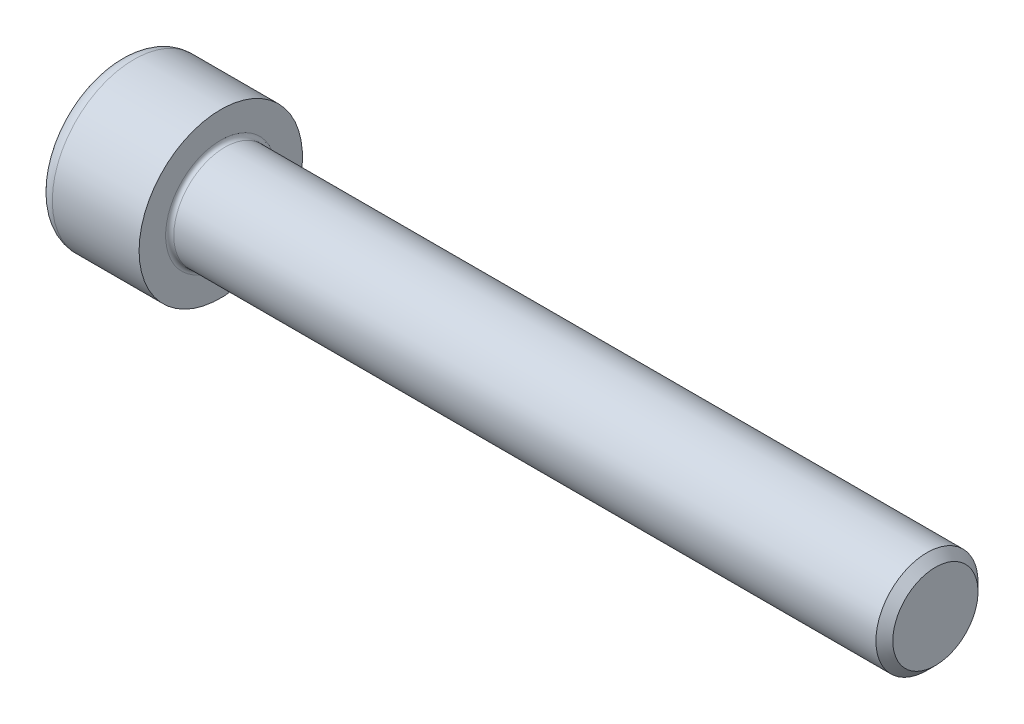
from build123d import *

# Parameters (mm, degrees)
FILLET1_R   = 0.4
FILLET2_R   = 1.5
HEX_2_DEPTH = 5


with BuildPart() as part:
    # BodySke → Base-Revolve (revolve)
    with BuildSketch(Plane.XY, mode=Mode.PRIVATE) as base_revolve_sk:
        Polygon((0, 0), (0, 8), (10, 8), (10, 5), (79.172, 5), (80, 4.172), (80, 0), align=None)
    revolve(base_revolve_sk.sketch.rotate(Axis((-31.75, 0, 0), (1, 0, 0)), 90), axis=Axis((-31.75, 0, 0), (1, 0, 0)))

    # Fillet1
    fillet1_edges = [part.edges().sort_by_distance(p)[0] for p in [
        (10, 0, -5),
    ]]
    fillet(fillet1_edges, radius=FILLET1_R)

    # Fillet2
    fillet2_edges = [part.edges().sort_by_distance(p)[0] for p in [
        (0, 0, -8),
    ]]
    fillet(fillet2_edges, radius=FILLET2_R)

    # Sketch2 → Hex-PreBroach (revolve, cut)
    with BuildSketch(Plane.XY, mode=Mode.PRIVATE) as hex_prebroach_sk:
        Polygon((0, 4.0575), (5, 4.0575), (7.342598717, 0), (0, 0), align=None)
    revolve(hex_prebroach_sk.sketch.rotate(Axis((0, 0, 0), (1, 0, 0)), 90), axis=Axis((0, 0, 0), (1, 0, 0)), mode=Mode.SUBTRACT)

    # Sketch3 → Hex 2 (cut)
    with BuildSketch(Plane(origin=(0, 0, 0), x_dir=(0, 0.500000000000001, 0.866025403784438), z_dir=(-1, 0, 0))):
        Polygon((2.342598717, 4.0575), (-2.342598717, 4.0575), (-4.685197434, 0), (-2.342598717, -4.0575), (2.342598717, -4.0575), (4.685197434, 0), align=None)
    extrude(amount=-HEX_2_DEPTH, mode=Mode.SUBTRACT)


solid = part.part
